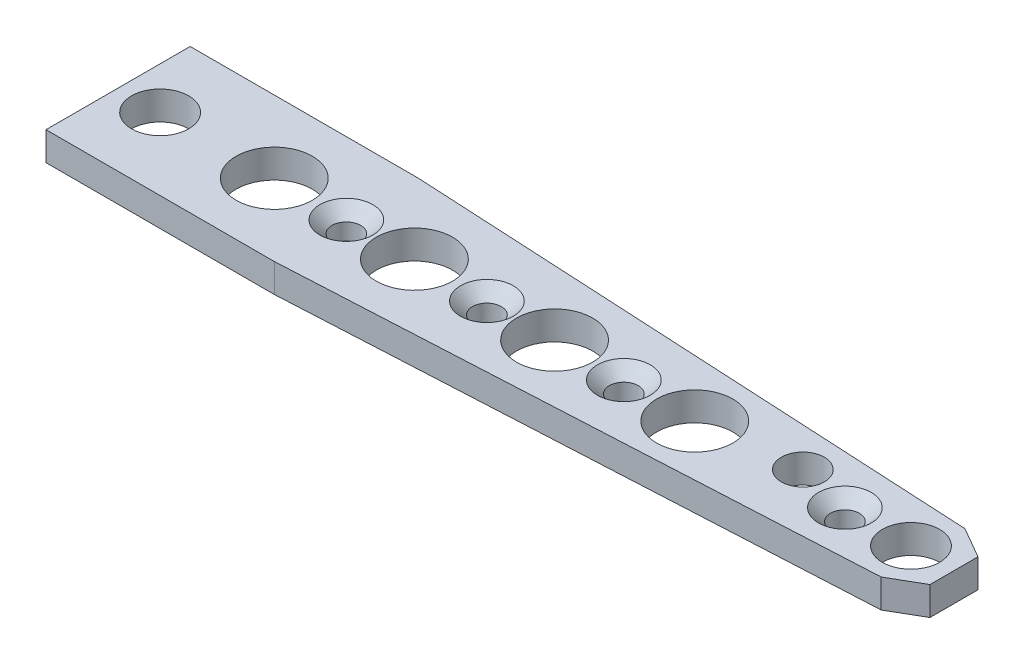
from build123d import *

# Parameters (mm, degrees)
BOSS_EXTRUDE1_DEPTH                             = 2.38
F_1_4_0_25_DIAMETER_HOLE1_D                     = 6.35
LPATTERN1_COUNT                                 = 4
LPATTERN1_PITCH                                 = 11.667
F_9_64_0_14063_DIAMETER_HOLE1_D                 = 3.572002
CSK_FOR_M2_FLAT_HEAD_MACHINE_SCREW1_D           = 2.4
CSK_FOR_M2_FLAT_HEAD_MACHINE_SCREW1_CSINK_D     = 4.4
CSK_FOR_M2_FLAT_HEAD_MACHINE_SCREW1_CSINK_ANGLE = 90
CHAMFER1_SIZE                                   = 1.35
CHAMFER1_SIZE2                                  = 2.575239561
F_3_16_0_1875_DIAMETER_HOLE1_D                  = 4.7625


with BuildPart() as part:
    # Sketch1 → Boss-Extrude1 (new body)
    with BuildSketch(Plane(origin=(0, 0, 0), x_dir=(1, 0, 0), z_dir=(0, 1, 0))):
        Polygon((69.58, 3.35), (19.014987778, 6), (0, 6), (0, -6), (19.014987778, -6), (69.58, -3.35), align=None)
    extrude(amount=BOSS_EXTRUDE1_DEPTH)

    # 1_4 _0.25_ Diameter Hole1 (through all)
    with Locations(Plane(origin=(0, 2.38, 0), x_dir=(1, 0, 0), z_dir=(0, 1, 0))):
        with Locations((13, 0)):
            f_1_4_0_25_diameter_hole1 = Hole(F_1_4_0_25_DIAMETER_HOLE1_D / 2)

    # LPattern1: 1_4 _0.25_ Diameter Hole1 ×4
    with Locations(*[(i * LPATTERN1_PITCH, 0, 0) for i in range(1, LPATTERN1_COUNT)]):
        add(f_1_4_0_25_diameter_hole1, mode=Mode.SUBTRACT)

    # 9_64 _0.14063_ Diameter Hole1 (through all)
    with Locations(Plane(origin=(0, 2.38, 0), x_dir=(1, 0, 0), z_dir=(0, 1, 0))):
        with Locations((56, 1)):
            Hole(F_9_64_0_14063_DIAMETER_HOLE1_D / 2)

    # CSK for M2 Flat Head Machine Screw1 (through all)
    with Locations(Plane(origin=(0, 2.38, 0), x_dir=(1, 0, 0), z_dir=(0, 1, 0))):
        with Locations((19, 0), (30.7, 0), (42.1, 0), (60.5, 0)):
            CounterSinkHole(CSK_FOR_M2_FLAT_HEAD_MACHINE_SCREW1_D / 2, CSK_FOR_M2_FLAT_HEAD_MACHINE_SCREW1_CSINK_D / 2, counter_sink_angle=CSK_FOR_M2_FLAT_HEAD_MACHINE_SCREW1_CSINK_ANGLE)

    # Chamfer1
    chamfer1_edges = [part.edges().sort_by_distance(p)[0] for p in [
        (69.58, 1.19, 3.35),
        (69.58, 1.19, -3.35),
    ]]
    chamfer1_side = [part.faces().sort_by_distance(p)[0] for p in [
        (69.58, 1.19, 0),
    ]]
    chamfer(chamfer1_edges, length=CHAMFER1_SIZE, length2=CHAMFER1_SIZE2, reference=chamfer1_side[0])

    # 3_16 _0.1875_ Diameter Hole1 (through all)
    with Locations(Plane(origin=(0, 2.38, 0), x_dir=(1, 0, 0), z_dir=(0, 1, 0))):
        with Locations((3.5, 0), (66, 0)):
            Hole(F_3_16_0_1875_DIAMETER_HOLE1_D / 2)


solid = part.part
